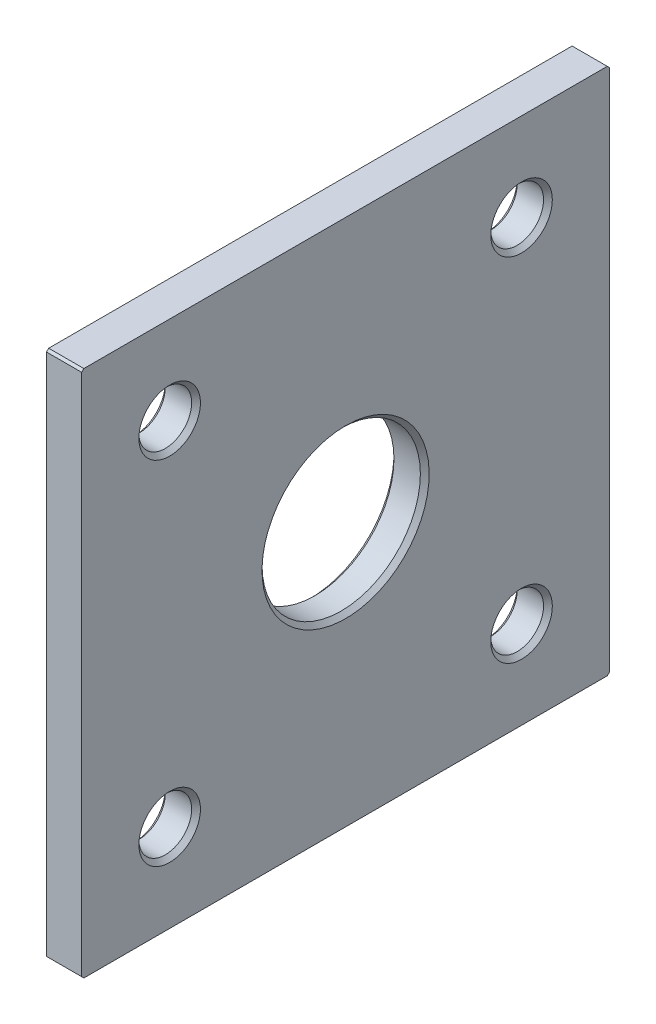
ISO-10303-21;
HEADER;
FILE_DESCRIPTION(('STEP AP214'),'2;1');
FILE_NAME('part.step','',(''),(''),'','','');
FILE_SCHEMA(('AUTOMOTIVE_DESIGN { 1 0 10303 214 1 1 1 1 }'));
ENDSEC;
DATA;
#1=APPLICATION_CONTEXT('core data for automotive mechanical design processes');
#2=APPLICATION_PROTOCOL_DEFINITION('international standard','automotive_design',2000,#1);
#3=PRODUCT_CONTEXT('',#1,'mechanical');
#4=PRODUCT('Part','Part','',(#3));
#5=PRODUCT_RELATED_PRODUCT_CATEGORY('part','',(#4));
#6=PRODUCT_DEFINITION_FORMATION('','',#4);
#7=PRODUCT_DEFINITION_CONTEXT('part definition',#1,'design');
#8=PRODUCT_DEFINITION('design','',#6,#7);
#9=PRODUCT_DEFINITION_SHAPE('','',#8);
#10=(LENGTH_UNIT() NAMED_UNIT(*) SI_UNIT(.MILLI.,.METRE.));
#11=(NAMED_UNIT(*) PLANE_ANGLE_UNIT() SI_UNIT($,.RADIAN.));
#12=(NAMED_UNIT(*) SI_UNIT($,.STERADIAN.) SOLID_ANGLE_UNIT());
#13=UNCERTAINTY_MEASURE_WITH_UNIT(LENGTH_MEASURE(1.E-05),#10,'distance_accuracy_value','');
#14=(GEOMETRIC_REPRESENTATION_CONTEXT(3) GLOBAL_UNCERTAINTY_ASSIGNED_CONTEXT((#13)) GLOBAL_UNIT_ASSIGNED_CONTEXT((#10,
#11,#12)) REPRESENTATION_CONTEXT('',''));
#15=CARTESIAN_POINT('',(0.,0.,0.));
#16=DIRECTION('',(0.,0.,1.));
#17=DIRECTION('',(1.,0.,0.));
#18=AXIS2_PLACEMENT_3D('',#15,#16,#17);
#19=CARTESIAN_POINT('',(-1.36772104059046E-13,0.,0.));
#20=DIRECTION('',(-1.,0.,0.));
#21=DIRECTION('',(0.,0.,1.));
#22=AXIS2_PLACEMENT_3D('',#19,#20,#21);
#23=CONICAL_SURFACE('',#22,9.49999999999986,0.785398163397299);
#24=CARTESIAN_POINT('',(0.5,0.,0.));
#25=DIRECTION('',(1.,0.,0.));
#26=DIRECTION('',(0.,0.,-1.));
#27=AXIS2_PLACEMENT_3D('',#24,#25,#26);
#28=CIRCLE('',#27,9.);
#29=CARTESIAN_POINT('',(0.5,0.,-9.));
#30=VERTEX_POINT('',#29);
#31=EDGE_CURVE('E129',#30,#30,#28,.T.);
#32=ORIENTED_EDGE('',*,*,#31,.T.);
#33=EDGE_LOOP('',(#32));
#34=FACE_BOUND('',#33,.T.);
#35=CARTESIAN_POINT('',(-1.37043154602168E-13,0.,0.));
#36=DIRECTION('',(-1.,0.,0.));
#37=DIRECTION('',(0.,0.,1.));
#38=AXIS2_PLACEMENT_3D('',#35,#36,#37);
#39=CIRCLE('',#38,9.49999999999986);
#40=CARTESIAN_POINT('',(-1.37043154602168E-13,0.,9.49999999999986));
#41=VERTEX_POINT('',#40);
#42=EDGE_CURVE('E19',#41,#41,#39,.T.);
#43=ORIENTED_EDGE('',*,*,#42,.T.);
#44=EDGE_LOOP('',(#43));
#45=FACE_BOUND('',#44,.T.);
#46=ADVANCED_FACE('F16',(#34,#45),#23,.F.);
#47=CARTESIAN_POINT('',(0.,-20.,-20.));
#48=DIRECTION('',(-1.,0.,0.));
#49=DIRECTION('',(0.,0.,1.));
#50=AXIS2_PLACEMENT_3D('',#47,#48,#49);
#51=CONICAL_SURFACE('',#50,3.50000000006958,0.785398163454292);
#52=CARTESIAN_POINT('',(0.5,-20.,-20.));
#53=DIRECTION('',(1.,0.,0.));
#54=DIRECTION('',(0.,0.,-1.));
#55=AXIS2_PLACEMENT_3D('',#52,#53,#54);
#56=CIRCLE('',#55,3.);
#57=CARTESIAN_POINT('',(0.5,-20.,-23.));
#58=VERTEX_POINT('',#57);
#59=EDGE_CURVE('E144',#58,#58,#56,.T.);
#60=ORIENTED_EDGE('',*,*,#59,.T.);
#61=EDGE_LOOP('',(#60));
#62=FACE_BOUND('',#61,.T.);
#63=CARTESIAN_POINT('',(3.86531084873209E-11,-20.,-20.));
#64=DIRECTION('',(-1.,0.,0.));
#65=DIRECTION('',(0.,0.,1.));
#66=AXIS2_PLACEMENT_3D('',#63,#64,#65);
#67=CIRCLE('',#66,3.50000000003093);
#68=CARTESIAN_POINT('',(3.86531084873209E-11,-20.,-16.4999999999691));
#69=VERTEX_POINT('',#68);
#70=EDGE_CURVE('E168',#69,#69,#67,.T.);
#71=ORIENTED_EDGE('',*,*,#70,.T.);
#72=EDGE_LOOP('',(#71));
#73=FACE_BOUND('',#72,.T.);
#74=ADVANCED_FACE('F324',(#62,#73),#51,.F.);
#75=CARTESIAN_POINT('',(0.,20.,-20.));
#76=DIRECTION('',(-1.,0.,0.));
#77=DIRECTION('',(0.,0.,1.));
#78=AXIS2_PLACEMENT_3D('',#75,#76,#77);
#79=CONICAL_SURFACE('',#78,3.50000000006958,0.785398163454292);
#80=CARTESIAN_POINT('',(0.5,20.,-20.));
#81=DIRECTION('',(1.,0.,0.));
#82=DIRECTION('',(0.,0.,-1.));
#83=AXIS2_PLACEMENT_3D('',#80,#81,#82);
#84=CIRCLE('',#83,3.);
#85=CARTESIAN_POINT('',(0.5,20.,-23.));
#86=VERTEX_POINT('',#85);
#87=EDGE_CURVE('E141',#86,#86,#84,.T.);
#88=ORIENTED_EDGE('',*,*,#87,.T.);
#89=EDGE_LOOP('',(#88));
#90=FACE_BOUND('',#89,.T.);
#91=CARTESIAN_POINT('',(-1.81903103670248E-11,20.,-20.));
#92=DIRECTION('',(-1.,0.,0.));
#93=DIRECTION('',(0.,0.,1.));
#94=AXIS2_PLACEMENT_3D('',#91,#92,#93);
#95=CIRCLE('',#94,3.50000000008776);
#96=CARTESIAN_POINT('',(-1.81903103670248E-11,20.,-16.4999999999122));
#97=VERTEX_POINT('',#96);
#98=EDGE_CURVE('E131',#97,#97,#95,.T.);
#99=ORIENTED_EDGE('',*,*,#98,.T.);
#100=EDGE_LOOP('',(#99));
#101=FACE_BOUND('',#100,.T.);
#102=ADVANCED_FACE('F321',(#90,#101),#79,.F.);
#103=CARTESIAN_POINT('',(5.6843418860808E-11,20.,20.));
#104=DIRECTION('',(-1.,0.,0.));
#105=DIRECTION('',(0.,0.,1.));
#106=AXIS2_PLACEMENT_3D('',#103,#104,#105);
#107=CONICAL_SURFACE('',#106,3.50000000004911,0.785398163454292);
#108=CARTESIAN_POINT('',(0.5,20.,20.));
#109=DIRECTION('',(1.,0.,0.));
#110=DIRECTION('',(0.,0.,-1.));
#111=AXIS2_PLACEMENT_3D('',#108,#109,#110);
#112=CIRCLE('',#111,3.);
#113=CARTESIAN_POINT('',(0.5,20.,17.));
#114=VERTEX_POINT('',#113);
#115=EDGE_CURVE('E106',#114,#114,#112,.T.);
#116=ORIENTED_EDGE('',*,*,#115,.T.);
#117=EDGE_LOOP('',(#116));
#118=FACE_BOUND('',#117,.T.);
#119=CARTESIAN_POINT('',(7.50337292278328E-11,20.,20.));
#120=DIRECTION('',(-1.,0.,0.));
#121=DIRECTION('',(0.,0.,1.));
#122=AXIS2_PLACEMENT_3D('',#119,#120,#121);
#123=CIRCLE('',#122,3.50000000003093);
#124=CARTESIAN_POINT('',(7.50337292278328E-11,20.,23.5000000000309));
#125=VERTEX_POINT('',#124);
#126=EDGE_CURVE('E163',#125,#125,#123,.T.);
#127=ORIENTED_EDGE('',*,*,#126,.T.);
#128=EDGE_LOOP('',(#127));
#129=FACE_BOUND('',#128,.T.);
#130=ADVANCED_FACE('F317',(#118,#129),#107,.F.);
#131=CARTESIAN_POINT('',(5.6843418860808E-11,-20.,20.));
#132=DIRECTION('',(-1.,0.,0.));
#133=DIRECTION('',(0.,0.,1.));
#134=AXIS2_PLACEMENT_3D('',#131,#132,#133);
#135=CONICAL_SURFACE('',#134,3.50000000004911,0.785398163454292);
#136=CARTESIAN_POINT('',(0.5,-20.,20.));
#137=DIRECTION('',(1.,0.,0.));
#138=DIRECTION('',(0.,0.,-1.));
#139=AXIS2_PLACEMENT_3D('',#136,#137,#138);
#140=CIRCLE('',#139,3.);
#141=CARTESIAN_POINT('',(0.5,-20.,17.));
#142=VERTEX_POINT('',#141);
#143=EDGE_CURVE('E103',#142,#142,#140,.T.);
#144=ORIENTED_EDGE('',*,*,#143,.T.);
#145=EDGE_LOOP('',(#144));
#146=FACE_BOUND('',#145,.T.);
#147=CARTESIAN_POINT('',(7.50337292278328E-11,-20.,20.));
#148=DIRECTION('',(-1.,0.,0.));
#149=DIRECTION('',(0.,0.,1.));
#150=AXIS2_PLACEMENT_3D('',#147,#148,#149);
#151=CIRCLE('',#150,3.50000000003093);
#152=CARTESIAN_POINT('',(7.50337292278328E-11,-20.,23.5000000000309));
#153=VERTEX_POINT('',#152);
#154=EDGE_CURVE('E166',#153,#153,#151,.T.);
#155=ORIENTED_EDGE('',*,*,#154,.T.);
#156=EDGE_LOOP('',(#155));
#157=FACE_BOUND('',#156,.T.);
#158=ADVANCED_FACE('F312',(#146,#157),#135,.F.);
#159=CARTESIAN_POINT('',(2.,-29.875,-29.875));
#160=DIRECTION('',(0.,-0.707106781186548,-0.707106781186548));
#161=DIRECTION('',(0.,0.707106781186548,-0.707106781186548));
#162=AXIS2_PLACEMENT_3D('',#159,#160,#161);
#163=PLANE('',#162);
#164=DIRECTION('',(1.,0.,0.));
#165=VECTOR('',#164,1.);
#166=CARTESIAN_POINT('',(0.,-30.,-29.75));
#167=LINE('',#166,#165);
#168=CARTESIAN_POINT('',(0.,-30.,-29.75));
#169=VERTEX_POINT('',#168);
#170=CARTESIAN_POINT('',(4.,-30.,-29.75));
#171=VERTEX_POINT('',#170);
#172=EDGE_CURVE('E93',#169,#171,#167,.T.);
#173=ORIENTED_EDGE('',*,*,#172,.F.);
#174=DIRECTION('',(0.,0.707106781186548,-0.707106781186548));
#175=VECTOR('',#174,1.);
#176=CARTESIAN_POINT('',(0.,-30.,-29.75));
#177=LINE('',#176,#175);
#178=CARTESIAN_POINT('',(0.,-29.75,-30.));
#179=VERTEX_POINT('',#178);
#180=EDGE_CURVE('E81',#169,#179,#177,.T.);
#181=ORIENTED_EDGE('',*,*,#180,.T.);
#182=DIRECTION('',(-1.,0.,0.));
#183=VECTOR('',#182,1.);
#184=CARTESIAN_POINT('',(0.,-29.75,-30.));
#185=LINE('',#184,#183);
#186=CARTESIAN_POINT('',(4.,-29.75,-30.));
#187=VERTEX_POINT('',#186);
#188=EDGE_CURVE('E293',#187,#179,#185,.T.);
#189=ORIENTED_EDGE('',*,*,#188,.F.);
#190=DIRECTION('',(0.,0.707106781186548,-0.707106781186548));
#191=VECTOR('',#190,1.);
#192=CARTESIAN_POINT('',(4.,-29.875,-29.875));
#193=LINE('',#192,#191);
#194=EDGE_CURVE('E95',#187,#171,#193,.F.);
#195=ORIENTED_EDGE('',*,*,#194,.T.);
#196=EDGE_LOOP('',(#173,#181,#189,#195));
#197=FACE_BOUND('',#196,.T.);
#198=ADVANCED_FACE('F94',(#197),#163,.T.);
#199=CARTESIAN_POINT('',(2.,29.875,-29.875));
#200=DIRECTION('',(0.,0.707106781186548,-0.707106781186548));
#201=DIRECTION('',(0.,0.707106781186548,0.707106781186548));
#202=AXIS2_PLACEMENT_3D('',#199,#200,#201);
#203=PLANE('',#202);
#204=DIRECTION('',(-1.,0.,0.));
#205=VECTOR('',#204,1.);
#206=CARTESIAN_POINT('',(0.,29.75,-30.));
#207=LINE('',#206,#205);
#208=CARTESIAN_POINT('',(0.,29.75,-30.));
#209=VERTEX_POINT('',#208);
#210=CARTESIAN_POINT('',(4.,29.75,-30.));
#211=VERTEX_POINT('',#210);
#212=EDGE_CURVE('E295',#209,#211,#207,.F.);
#213=ORIENTED_EDGE('',*,*,#212,.F.);
#214=DIRECTION('',(0.,0.707106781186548,0.707106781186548));
#215=VECTOR('',#214,1.);
#216=CARTESIAN_POINT('',(0.,29.75,-30.));
#217=LINE('',#216,#215);
#218=CARTESIAN_POINT('',(0.,30.,-29.75));
#219=VERTEX_POINT('',#218);
#220=EDGE_CURVE('E89',#209,#219,#217,.T.);
#221=ORIENTED_EDGE('',*,*,#220,.T.);
#222=DIRECTION('',(1.,0.,0.));
#223=VECTOR('',#222,1.);
#224=CARTESIAN_POINT('',(0.,30.,-29.75));
#225=LINE('',#224,#223);
#226=CARTESIAN_POINT('',(4.,30.,-29.75));
#227=VERTEX_POINT('',#226);
#228=EDGE_CURVE('E290',#227,#219,#225,.F.);
#229=ORIENTED_EDGE('',*,*,#228,.F.);
#230=DIRECTION('',(0.,0.707106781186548,0.707106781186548));
#231=VECTOR('',#230,1.);
#232=CARTESIAN_POINT('',(4.,29.875,-29.875));
#233=LINE('',#232,#231);
#234=EDGE_CURVE('E136',#227,#211,#233,.F.);
#235=ORIENTED_EDGE('',*,*,#234,.T.);
#236=EDGE_LOOP('',(#213,#221,#229,#235));
#237=FACE_BOUND('',#236,.T.);
#238=ADVANCED_FACE('F189',(#237),#203,.T.);
#239=CARTESIAN_POINT('',(2.,29.875,29.875));
#240=DIRECTION('',(0.,0.707106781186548,0.707106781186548));
#241=DIRECTION('',(0.,-0.707106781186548,0.707106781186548));
#242=AXIS2_PLACEMENT_3D('',#239,#240,#241);
#243=PLANE('',#242);
#244=DIRECTION('',(1.,0.,0.));
#245=VECTOR('',#244,1.);
#246=CARTESIAN_POINT('',(0.,30.,29.75));
#247=LINE('',#246,#245);
#248=CARTESIAN_POINT('',(0.,30.,29.75));
#249=VERTEX_POINT('',#248);
#250=CARTESIAN_POINT('',(4.,30.,29.75));
#251=VERTEX_POINT('',#250);
#252=EDGE_CURVE('E284',#249,#251,#247,.T.);
#253=ORIENTED_EDGE('',*,*,#252,.F.);
#254=DIRECTION('',(0.,-0.707106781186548,0.707106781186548));
#255=VECTOR('',#254,1.);
#256=CARTESIAN_POINT('',(0.,30.,29.75));
#257=LINE('',#256,#255);
#258=CARTESIAN_POINT('',(0.,29.75,30.));
#259=VERTEX_POINT('',#258);
#260=EDGE_CURVE('E132',#249,#259,#257,.T.);
#261=ORIENTED_EDGE('',*,*,#260,.T.);
#262=DIRECTION('',(1.,0.,0.));
#263=VECTOR('',#262,1.);
#264=CARTESIAN_POINT('',(0.,29.75,30.));
#265=LINE('',#264,#263);
#266=CARTESIAN_POINT('',(4.,29.75,30.));
#267=VERTEX_POINT('',#266);
#268=EDGE_CURVE('E282',#267,#259,#265,.F.);
#269=ORIENTED_EDGE('',*,*,#268,.F.);
#270=DIRECTION('',(0.,-0.707106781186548,0.707106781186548));
#271=VECTOR('',#270,1.);
#272=CARTESIAN_POINT('',(4.,29.875,29.875));
#273=LINE('',#272,#271);
#274=EDGE_CURVE('E90',#267,#251,#273,.F.);
#275=ORIENTED_EDGE('',*,*,#274,.T.);
#276=EDGE_LOOP('',(#253,#261,#269,#275));
#277=FACE_BOUND('',#276,.T.);
#278=ADVANCED_FACE('F178',(#277),#243,.T.);
#279=CARTESIAN_POINT('',(0.,0.,0.));
#280=DIRECTION('',(1.,0.,0.));
#281=DIRECTION('',(0.,0.,-1.));
#282=AXIS2_PLACEMENT_3D('',#279,#280,#281);
#283=PLANE('',#282);
#284=ORIENTED_EDGE('',*,*,#98,.F.);
#285=EDGE_LOOP('',(#284));
#286=FACE_BOUND('',#285,.T.);
#287=ORIENTED_EDGE('',*,*,#126,.F.);
#288=EDGE_LOOP('',(#287));
#289=FACE_BOUND('',#288,.T.);
#290=ORIENTED_EDGE('',*,*,#154,.F.);
#291=EDGE_LOOP('',(#290));
#292=FACE_BOUND('',#291,.T.);
#293=ORIENTED_EDGE('',*,*,#70,.F.);
#294=EDGE_LOOP('',(#293));
#295=FACE_BOUND('',#294,.T.);
#296=ORIENTED_EDGE('',*,*,#42,.F.);
#297=EDGE_LOOP('',(#296));
#298=FACE_BOUND('',#297,.T.);
#299=ORIENTED_EDGE('',*,*,#260,.F.);
#300=DIRECTION('',(0.,0.,1.));
#301=VECTOR('',#300,1.);
#302=CARTESIAN_POINT('',(0.,30.,-30.));
#303=LINE('',#302,#301);
#304=EDGE_CURVE('E287',#219,#249,#303,.T.);
#305=ORIENTED_EDGE('',*,*,#304,.F.);
#306=ORIENTED_EDGE('',*,*,#220,.F.);
#307=DIRECTION('',(0.,1.,0.));
#308=VECTOR('',#307,1.);
#309=CARTESIAN_POINT('',(0.,-30.,-30.));
#310=LINE('',#309,#308);
#311=EDGE_CURVE('E85',#179,#209,#310,.T.);
#312=ORIENTED_EDGE('',*,*,#311,.F.);
#313=ORIENTED_EDGE('',*,*,#180,.F.);
#314=DIRECTION('',(0.,0.,-1.));
#315=VECTOR('',#314,1.);
#316=CARTESIAN_POINT('',(0.,-30.,30.));
#317=LINE('',#316,#315);
#318=CARTESIAN_POINT('',(0.,-30.,29.75));
#319=VERTEX_POINT('',#318);
#320=EDGE_CURVE('E78',#319,#169,#317,.T.);
#321=ORIENTED_EDGE('',*,*,#320,.F.);
#322=DIRECTION('',(0.,-0.707106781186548,-0.707106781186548));
#323=VECTOR('',#322,1.);
#324=CARTESIAN_POINT('',(0.,-29.875,29.875));
#325=LINE('',#324,#323);
#326=CARTESIAN_POINT('',(0.,-29.75,30.));
#327=VERTEX_POINT('',#326);
#328=EDGE_CURVE('E127',#327,#319,#325,.T.);
#329=ORIENTED_EDGE('',*,*,#328,.F.);
#330=DIRECTION('',(0.,1.,0.));
#331=VECTOR('',#330,1.);
#332=CARTESIAN_POINT('',(0.,30.,30.));
#333=LINE('',#332,#331);
#334=EDGE_CURVE('E279',#259,#327,#333,.F.);
#335=ORIENTED_EDGE('',*,*,#334,.F.);
#336=EDGE_LOOP('',(#299,#305,#306,#312,#313,#321,#329,#335));
#337=FACE_BOUND('',#336,.T.);
#338=ADVANCED_FACE('F83',(#286,#289,#292,#295,#298,#337),#283,.F.);
#339=CARTESIAN_POINT('',(2.,-29.875,29.875));
#340=DIRECTION('',(0.,-0.707106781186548,0.707106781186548));
#341=DIRECTION('',(0.,-0.707106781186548,-0.707106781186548));
#342=AXIS2_PLACEMENT_3D('',#339,#340,#341);
#343=PLANE('',#342);
#344=DIRECTION('',(1.,0.,0.));
#345=VECTOR('',#344,1.);
#346=CARTESIAN_POINT('',(0.,-29.75,30.));
#347=LINE('',#346,#345);
#348=CARTESIAN_POINT('',(4.,-29.75,30.));
#349=VERTEX_POINT('',#348);
#350=EDGE_CURVE('E126',#327,#349,#347,.T.);
#351=ORIENTED_EDGE('',*,*,#350,.F.);
#352=ORIENTED_EDGE('',*,*,#328,.T.);
#353=DIRECTION('',(1.,0.,0.));
#354=VECTOR('',#353,1.);
#355=CARTESIAN_POINT('',(0.,-30.,29.75));
#356=LINE('',#355,#354);
#357=CARTESIAN_POINT('',(4.,-30.,29.75));
#358=VERTEX_POINT('',#357);
#359=EDGE_CURVE('E99',#358,#319,#356,.F.);
#360=ORIENTED_EDGE('',*,*,#359,.F.);
#361=DIRECTION('',(0.,-0.707106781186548,-0.707106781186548));
#362=VECTOR('',#361,1.);
#363=CARTESIAN_POINT('',(4.,-29.875,29.875));
#364=LINE('',#363,#362);
#365=EDGE_CURVE('E34',#358,#349,#364,.F.);
#366=ORIENTED_EDGE('',*,*,#365,.T.);
#367=EDGE_LOOP('',(#351,#352,#360,#366));
#368=FACE_BOUND('',#367,.T.);
#369=ADVANCED_FACE('F177',(#368),#343,.T.);
#370=CARTESIAN_POINT('',(4.,0.,0.));
#371=DIRECTION('',(1.,0.,0.));
#372=DIRECTION('',(0.,0.,-1.));
#373=AXIS2_PLACEMENT_3D('',#370,#371,#372);
#374=CYLINDRICAL_SURFACE('',#373,9.);
#375=ORIENTED_EDGE('',*,*,#31,.F.);
#376=EDGE_LOOP('',(#375));
#377=FACE_BOUND('',#376,.T.);
#378=CARTESIAN_POINT('',(3.49999999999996,0.,0.));
#379=DIRECTION('',(1.,0.,0.));
#380=DIRECTION('',(0.,0.,-1.));
#381=AXIS2_PLACEMENT_3D('',#378,#379,#380);
#382=CIRCLE('',#381,9.);
#383=CARTESIAN_POINT('',(3.49999999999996,0.,-8.99999999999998));
#384=VERTEX_POINT('',#383);
#385=EDGE_CURVE('E123',#384,#384,#382,.T.);
#386=ORIENTED_EDGE('',*,*,#385,.T.);
#387=EDGE_LOOP('',(#386));
#388=FACE_BOUND('',#387,.T.);
#389=ADVANCED_FACE('F187',(#377,#388),#374,.F.);
#390=CARTESIAN_POINT('',(4.,-20.,-20.));
#391=DIRECTION('',(1.,0.,0.));
#392=DIRECTION('',(0.,0.,-1.));
#393=AXIS2_PLACEMENT_3D('',#390,#391,#392);
#394=CYLINDRICAL_SURFACE('',#393,3.);
#395=ORIENTED_EDGE('',*,*,#59,.F.);
#396=EDGE_LOOP('',(#395));
#397=FACE_BOUND('',#396,.T.);
#398=CARTESIAN_POINT('',(3.49999999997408,-20.,-20.));
#399=DIRECTION('',(1.,0.,0.));
#400=DIRECTION('',(0.,0.,-1.));
#401=AXIS2_PLACEMENT_3D('',#398,#399,#400);
#402=CIRCLE('',#401,2.99999999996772);
#403=CARTESIAN_POINT('',(3.49999999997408,-20.,-22.9999999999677));
#404=VERTEX_POINT('',#403);
#405=EDGE_CURVE('E120',#404,#404,#402,.T.);
#406=ORIENTED_EDGE('',*,*,#405,.T.);
#407=EDGE_LOOP('',(#406));
#408=FACE_BOUND('',#407,.T.);
#409=ADVANCED_FACE('F248',(#397,#408),#394,.F.);
#410=CARTESIAN_POINT('',(4.,20.,-20.));
#411=DIRECTION('',(1.,0.,0.));
#412=DIRECTION('',(0.,0.,-1.));
#413=AXIS2_PLACEMENT_3D('',#410,#411,#412);
#414=CYLINDRICAL_SURFACE('',#413,3.);
#415=ORIENTED_EDGE('',*,*,#87,.F.);
#416=EDGE_LOOP('',(#415));
#417=FACE_BOUND('',#416,.T.);
#418=CARTESIAN_POINT('',(3.49999999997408,20.,-20.));
#419=DIRECTION('',(1.,0.,0.));
#420=DIRECTION('',(0.,0.,-1.));
#421=AXIS2_PLACEMENT_3D('',#418,#419,#420);
#422=CIRCLE('',#421,2.99999999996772);
#423=CARTESIAN_POINT('',(3.49999999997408,20.,-22.9999999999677));
#424=VERTEX_POINT('',#423);
#425=EDGE_CURVE('E117',#424,#424,#422,.T.);
#426=ORIENTED_EDGE('',*,*,#425,.T.);
#427=EDGE_LOOP('',(#426));
#428=FACE_BOUND('',#427,.T.);
#429=ADVANCED_FACE('F244',(#417,#428),#414,.F.);
#430=CARTESIAN_POINT('',(4.,20.,20.));
#431=DIRECTION('',(1.,0.,0.));
#432=DIRECTION('',(0.,0.,-1.));
#433=AXIS2_PLACEMENT_3D('',#430,#431,#432);
#434=CYLINDRICAL_SURFACE('',#433,3.);
#435=ORIENTED_EDGE('',*,*,#115,.F.);
#436=EDGE_LOOP('',(#435));
#437=FACE_BOUND('',#436,.T.);
#438=CARTESIAN_POINT('',(3.49999999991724,20.,20.));
#439=DIRECTION('',(1.,0.,0.));
#440=DIRECTION('',(0.,0.,-1.));
#441=AXIS2_PLACEMENT_3D('',#438,#439,#440);
#442=CIRCLE('',#441,3.00000000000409);
#443=CARTESIAN_POINT('',(3.49999999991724,20.,16.9999999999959));
#444=VERTEX_POINT('',#443);
#445=EDGE_CURVE('E114',#444,#444,#442,.T.);
#446=ORIENTED_EDGE('',*,*,#445,.T.);
#447=EDGE_LOOP('',(#446));
#448=FACE_BOUND('',#447,.T.);
#449=ADVANCED_FACE('F240',(#437,#448),#434,.F.);
#450=CARTESIAN_POINT('',(4.,-20.,20.));
#451=DIRECTION('',(1.,0.,0.));
#452=DIRECTION('',(0.,0.,-1.));
#453=AXIS2_PLACEMENT_3D('',#450,#451,#452);
#454=CYLINDRICAL_SURFACE('',#453,3.);
#455=ORIENTED_EDGE('',*,*,#143,.F.);
#456=EDGE_LOOP('',(#455));
#457=FACE_BOUND('',#456,.T.);
#458=CARTESIAN_POINT('',(3.49999999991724,-20.,20.));
#459=DIRECTION('',(1.,0.,0.));
#460=DIRECTION('',(0.,0.,-1.));
#461=AXIS2_PLACEMENT_3D('',#458,#459,#460);
#462=CIRCLE('',#461,3.00000000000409);
#463=CARTESIAN_POINT('',(3.49999999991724,-20.,16.9999999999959));
#464=VERTEX_POINT('',#463);
#465=EDGE_CURVE('E110',#464,#464,#462,.T.);
#466=ORIENTED_EDGE('',*,*,#465,.T.);
#467=EDGE_LOOP('',(#466));
#468=FACE_BOUND('',#467,.T.);
#469=ADVANCED_FACE('F237',(#457,#468),#454,.F.);
#470=CARTESIAN_POINT('',(0.,-30.,30.));
#471=DIRECTION('',(0.,-1.,0.));
#472=DIRECTION('',(0.,0.,-1.));
#473=AXIS2_PLACEMENT_3D('',#470,#471,#472);
#474=PLANE('',#473);
#475=DIRECTION('',(0.,0.,-1.));
#476=VECTOR('',#475,1.);
#477=CARTESIAN_POINT('',(4.,-30.,0.));
#478=LINE('',#477,#476);
#479=EDGE_CURVE('E113',#358,#171,#478,.T.);
#480=ORIENTED_EDGE('',*,*,#479,.F.);
#481=ORIENTED_EDGE('',*,*,#359,.T.);
#482=ORIENTED_EDGE('',*,*,#320,.T.);
#483=ORIENTED_EDGE('',*,*,#172,.T.);
#484=EDGE_LOOP('',(#480,#481,#482,#483));
#485=FACE_BOUND('',#484,.T.);
#486=ADVANCED_FACE('F102',(#485),#474,.T.);
#487=CARTESIAN_POINT('',(0.,-30.,-30.));
#488=DIRECTION('',(0.,0.,-1.));
#489=DIRECTION('',(-1.,0.,0.));
#490=AXIS2_PLACEMENT_3D('',#487,#488,#489);
#491=PLANE('',#490);
#492=DIRECTION('',(0.,1.,0.));
#493=VECTOR('',#492,1.);
#494=CARTESIAN_POINT('',(4.,0.,-30.));
#495=LINE('',#494,#493);
#496=EDGE_CURVE('E272',#187,#211,#495,.T.);
#497=ORIENTED_EDGE('',*,*,#496,.F.);
#498=ORIENTED_EDGE('',*,*,#188,.T.);
#499=ORIENTED_EDGE('',*,*,#311,.T.);
#500=ORIENTED_EDGE('',*,*,#212,.T.);
#501=EDGE_LOOP('',(#497,#498,#499,#500));
#502=FACE_BOUND('',#501,.T.);
#503=ADVANCED_FACE('F230',(#502),#491,.T.);
#504=CARTESIAN_POINT('',(0.,30.,-30.));
#505=DIRECTION('',(0.,1.,0.));
#506=DIRECTION('',(0.,0.,1.));
#507=AXIS2_PLACEMENT_3D('',#504,#505,#506);
#508=PLANE('',#507);
#509=ORIENTED_EDGE('',*,*,#304,.T.);
#510=ORIENTED_EDGE('',*,*,#252,.T.);
#511=DIRECTION('',(0.,0.,-1.));
#512=VECTOR('',#511,1.);
#513=CARTESIAN_POINT('',(4.,30.,0.));
#514=LINE('',#513,#512);
#515=EDGE_CURVE('E270',#227,#251,#514,.F.);
#516=ORIENTED_EDGE('',*,*,#515,.F.);
#517=ORIENTED_EDGE('',*,*,#228,.T.);
#518=EDGE_LOOP('',(#509,#510,#516,#517));
#519=FACE_BOUND('',#518,.T.);
#520=ADVANCED_FACE('F226',(#519),#508,.T.);
#521=CARTESIAN_POINT('',(0.,30.,30.));
#522=DIRECTION('',(0.,0.,1.));
#523=DIRECTION('',(1.,0.,0.));
#524=AXIS2_PLACEMENT_3D('',#521,#522,#523);
#525=PLANE('',#524);
#526=ORIENTED_EDGE('',*,*,#334,.T.);
#527=ORIENTED_EDGE('',*,*,#350,.T.);
#528=DIRECTION('',(0.,1.,0.));
#529=VECTOR('',#528,1.);
#530=CARTESIAN_POINT('',(4.,0.,30.));
#531=LINE('',#530,#529);
#532=EDGE_CURVE('E160',#267,#349,#531,.F.);
#533=ORIENTED_EDGE('',*,*,#532,.F.);
#534=ORIENTED_EDGE('',*,*,#268,.T.);
#535=EDGE_LOOP('',(#526,#527,#533,#534));
#536=FACE_BOUND('',#535,.T.);
#537=ADVANCED_FACE('F222',(#536),#525,.T.);
#538=CARTESIAN_POINT('',(4.,0.,0.));
#539=DIRECTION('',(1.,0.,0.));
#540=DIRECTION('',(0.,1.,0.));
#541=AXIS2_PLACEMENT_3D('',#538,#539,#540);
#542=CONICAL_SURFACE('',#541,9.5,0.785398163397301);
#543=ORIENTED_EDGE('',*,*,#385,.F.);
#544=EDGE_LOOP('',(#543));
#545=FACE_BOUND('',#544,.T.);
#546=CARTESIAN_POINT('',(4.,0.,0.));
#547=DIRECTION('',(1.,0.,0.));
#548=DIRECTION('',(0.,1.,0.));
#549=AXIS2_PLACEMENT_3D('',#546,#547,#548);
#550=CIRCLE('',#549,9.5);
#551=CARTESIAN_POINT('',(4.,9.5,0.));
#552=VERTEX_POINT('',#551);
#553=EDGE_CURVE('E157',#552,#552,#550,.F.);
#554=ORIENTED_EDGE('',*,*,#553,.F.);
#555=EDGE_LOOP('',(#554));
#556=FACE_BOUND('',#555,.T.);
#557=ADVANCED_FACE('F218',(#545,#556),#542,.F.);
#558=CARTESIAN_POINT('',(3.99999999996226,-20.,-20.));
#559=DIRECTION('',(1.,0.,0.));
#560=DIRECTION('',(0.,0.,-1.));
#561=AXIS2_PLACEMENT_3D('',#558,#559,#560);
#562=CONICAL_SURFACE('',#561,3.49999999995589,0.785398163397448);
#563=ORIENTED_EDGE('',*,*,#405,.F.);
#564=EDGE_LOOP('',(#563));
#565=FACE_BOUND('',#564,.T.);
#566=CARTESIAN_POINT('',(3.99999999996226,-20.,-20.));
#567=DIRECTION('',(1.,0.,0.));
#568=DIRECTION('',(0.,0.,-1.));
#569=AXIS2_PLACEMENT_3D('',#566,#567,#568);
#570=CIRCLE('',#569,3.49999999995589);
#571=CARTESIAN_POINT('',(3.99999999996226,-20.,-23.4999999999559));
#572=VERTEX_POINT('',#571);
#573=EDGE_CURVE('E154',#572,#572,#570,.F.);
#574=ORIENTED_EDGE('',*,*,#573,.F.);
#575=EDGE_LOOP('',(#574));
#576=FACE_BOUND('',#575,.T.);
#577=ADVANCED_FACE('F214',(#565,#576),#562,.F.);
#578=CARTESIAN_POINT('',(3.99999999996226,20.,-20.));
#579=DIRECTION('',(1.,0.,0.));
#580=DIRECTION('',(0.,0.,-1.));
#581=AXIS2_PLACEMENT_3D('',#578,#579,#580);
#582=CONICAL_SURFACE('',#581,3.49999999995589,0.785398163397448);
#583=ORIENTED_EDGE('',*,*,#425,.F.);
#584=EDGE_LOOP('',(#583));
#585=FACE_BOUND('',#584,.T.);
#586=CARTESIAN_POINT('',(3.99999999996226,20.,-20.));
#587=DIRECTION('',(1.,0.,0.));
#588=DIRECTION('',(0.,0.,-1.));
#589=AXIS2_PLACEMENT_3D('',#586,#587,#588);
#590=CIRCLE('',#589,3.49999999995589);
#591=CARTESIAN_POINT('',(3.99999999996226,20.,-23.4999999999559));
#592=VERTEX_POINT('',#591);
#593=EDGE_CURVE('E151',#592,#592,#590,.F.);
#594=ORIENTED_EDGE('',*,*,#593,.F.);
#595=EDGE_LOOP('',(#594));
#596=FACE_BOUND('',#595,.T.);
#597=ADVANCED_FACE('F210',(#585,#596),#582,.F.);
#598=CARTESIAN_POINT('',(4.0000000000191,20.,20.));
#599=DIRECTION('',(1.,0.,0.));
#600=DIRECTION('',(0.,0.,-1.));
#601=AXIS2_PLACEMENT_3D('',#598,#599,#600);
#602=CONICAL_SURFACE('',#601,3.50000000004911,0.785398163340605);
#603=ORIENTED_EDGE('',*,*,#445,.F.);
#604=EDGE_LOOP('',(#603));
#605=FACE_BOUND('',#604,.T.);
#606=CARTESIAN_POINT('',(4.0000000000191,20.,20.));
#607=DIRECTION('',(1.,0.,0.));
#608=DIRECTION('',(0.,0.,-1.));
#609=AXIS2_PLACEMENT_3D('',#606,#607,#608);
#610=CIRCLE('',#609,3.50000000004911);
#611=CARTESIAN_POINT('',(4.0000000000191,20.,16.4999999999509));
#612=VERTEX_POINT('',#611);
#613=EDGE_CURVE('E25',#612,#612,#610,.F.);
#614=ORIENTED_EDGE('',*,*,#613,.F.);
#615=EDGE_LOOP('',(#614));
#616=FACE_BOUND('',#615,.T.);
#617=ADVANCED_FACE('F203',(#605,#616),#602,.F.);
#618=CARTESIAN_POINT('',(4.0000000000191,-20.,20.));
#619=DIRECTION('',(1.,0.,0.));
#620=DIRECTION('',(0.,0.,-1.));
#621=AXIS2_PLACEMENT_3D('',#618,#619,#620);
#622=CONICAL_SURFACE('',#621,3.50000000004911,0.785398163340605);
#623=ORIENTED_EDGE('',*,*,#465,.F.);
#624=EDGE_LOOP('',(#623));
#625=FACE_BOUND('',#624,.T.);
#626=CARTESIAN_POINT('',(4.0000000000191,-20.,20.));
#627=DIRECTION('',(1.,0.,0.));
#628=DIRECTION('',(0.,0.,-1.));
#629=AXIS2_PLACEMENT_3D('',#626,#627,#628);
#630=CIRCLE('',#629,3.50000000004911);
#631=CARTESIAN_POINT('',(4.0000000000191,-20.,16.4999999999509));
#632=VERTEX_POINT('',#631);
#633=EDGE_CURVE('E11',#632,#632,#630,.F.);
#634=ORIENTED_EDGE('',*,*,#633,.F.);
#635=EDGE_LOOP('',(#634));
#636=FACE_BOUND('',#635,.T.);
#637=ADVANCED_FACE('F196',(#625,#636),#622,.F.);
#638=CARTESIAN_POINT('',(4.,0.,0.));
#639=DIRECTION('',(1.,0.,0.));
#640=DIRECTION('',(0.,0.,-1.));
#641=AXIS2_PLACEMENT_3D('',#638,#639,#640);
#642=PLANE('',#641);
#643=ORIENTED_EDGE('',*,*,#633,.T.);
#644=EDGE_LOOP('',(#643));
#645=FACE_BOUND('',#644,.T.);
#646=ORIENTED_EDGE('',*,*,#613,.T.);
#647=EDGE_LOOP('',(#646));
#648=FACE_BOUND('',#647,.T.);
#649=ORIENTED_EDGE('',*,*,#593,.T.);
#650=EDGE_LOOP('',(#649));
#651=FACE_BOUND('',#650,.T.);
#652=ORIENTED_EDGE('',*,*,#573,.T.);
#653=EDGE_LOOP('',(#652));
#654=FACE_BOUND('',#653,.T.);
#655=ORIENTED_EDGE('',*,*,#553,.T.);
#656=EDGE_LOOP('',(#655));
#657=FACE_BOUND('',#656,.T.);
#658=ORIENTED_EDGE('',*,*,#532,.T.);
#659=ORIENTED_EDGE('',*,*,#365,.F.);
#660=ORIENTED_EDGE('',*,*,#479,.T.);
#661=ORIENTED_EDGE('',*,*,#194,.F.);
#662=ORIENTED_EDGE('',*,*,#496,.T.);
#663=ORIENTED_EDGE('',*,*,#234,.F.);
#664=ORIENTED_EDGE('',*,*,#515,.T.);
#665=ORIENTED_EDGE('',*,*,#274,.F.);
#666=EDGE_LOOP('',(#658,#659,#660,#661,#662,#663,#664,#665));
#667=FACE_BOUND('',#666,.T.);
#668=ADVANCED_FACE('F194',(#645,#648,#651,#654,#657,#667),#642,.T.);
#669=CLOSED_SHELL('',(#46,#74,#102,#130,#158,#198,#238,#278,#338,#369,#389,#409,#429,#449,#469,
#486,#503,#520,#537,#557,#577,#597,#617,#637,#668));
#670=MANIFOLD_SOLID_BREP('B1',#669);
#671=ADVANCED_BREP_SHAPE_REPRESENTATION('',(#18,#670),#14);
#672=SHAPE_DEFINITION_REPRESENTATION(#9,#671);
ENDSEC;
END-ISO-10303-21;
